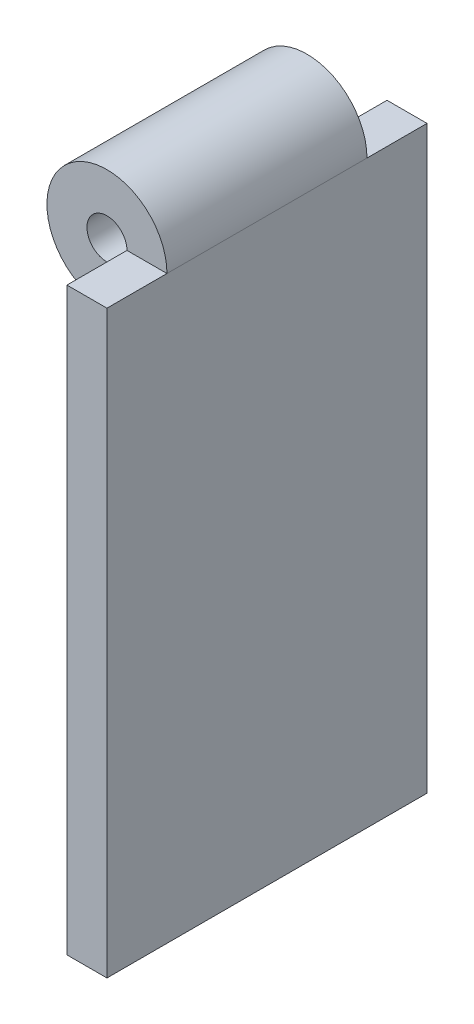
from build123d import *

# Parameters (mm, degrees)
SKETCH1_W      = 10
SKETCH1_H      = 145
EXTRUDE1_DEPTH = 40
EXTRUDE3_DEPTH = 25


with BuildPart() as part:
    # Sketch1 → Extrude1 (new, symmetric)
    with BuildSketch(Plane.XY):
        with Locations((5, -72.5)):
            Rectangle(SKETCH1_W, SKETCH1_H)
    extrude(amount=EXTRUDE1_DEPTH, both=True)

    # Sketch1_4 → Extrude3 (add, symmetric)
    with BuildSketch(Plane.XY):
        with BuildLine():
            ThreePointArc((-5, -5), (-8.535533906, 3.535533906), (0, 0))
            Line((0, 0), (10, 0))
            ThreePointArc((10, 0), (-15.606601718, 10.606601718), (-5, -15))
            Line((-5, -15), (-5, -5))
        make_face()
    extrude(amount=EXTRUDE3_DEPTH, both=True)


solid = part.part
